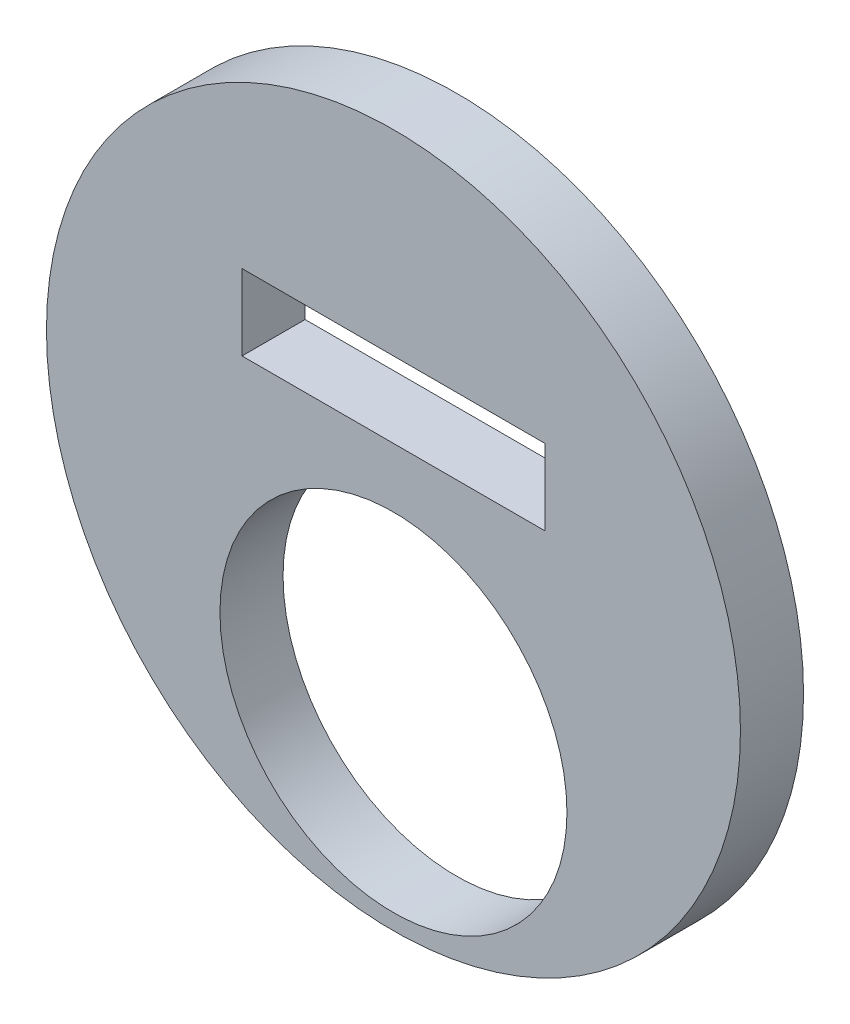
from build123d import *

# Parameters (mm, degrees)
SKETCH1_R          = 17.4625
SKETCH1_W          = 15.24
SKETCH1_H          = 3.81
EXTRUDE1_DEPTH     = 3.175
SKETCH2_R          = 8.731250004
CUT_EXTRUDE1_DEPTH = 3.175


with BuildPart() as part:
    # Sketch1 → Extrude1 (new body)
    with BuildSketch(Plane.XY):
        Circle(SKETCH1_R)
        with Locations((0, 5.6896)):
            Rectangle(SKETCH1_W, SKETCH1_H, mode=Mode.SUBTRACT)
    extrude(amount=EXTRUDE1_DEPTH)

    # Sketch2 → Cut-Extrude1 (cut)
    with BuildSketch(Plane.XY.offset(3.175)):
        with Locations((0, -7.9375)):
            Circle(SKETCH2_R)
    extrude(amount=-CUT_EXTRUDE1_DEPTH, mode=Mode.SUBTRACT)


solid = part.part
